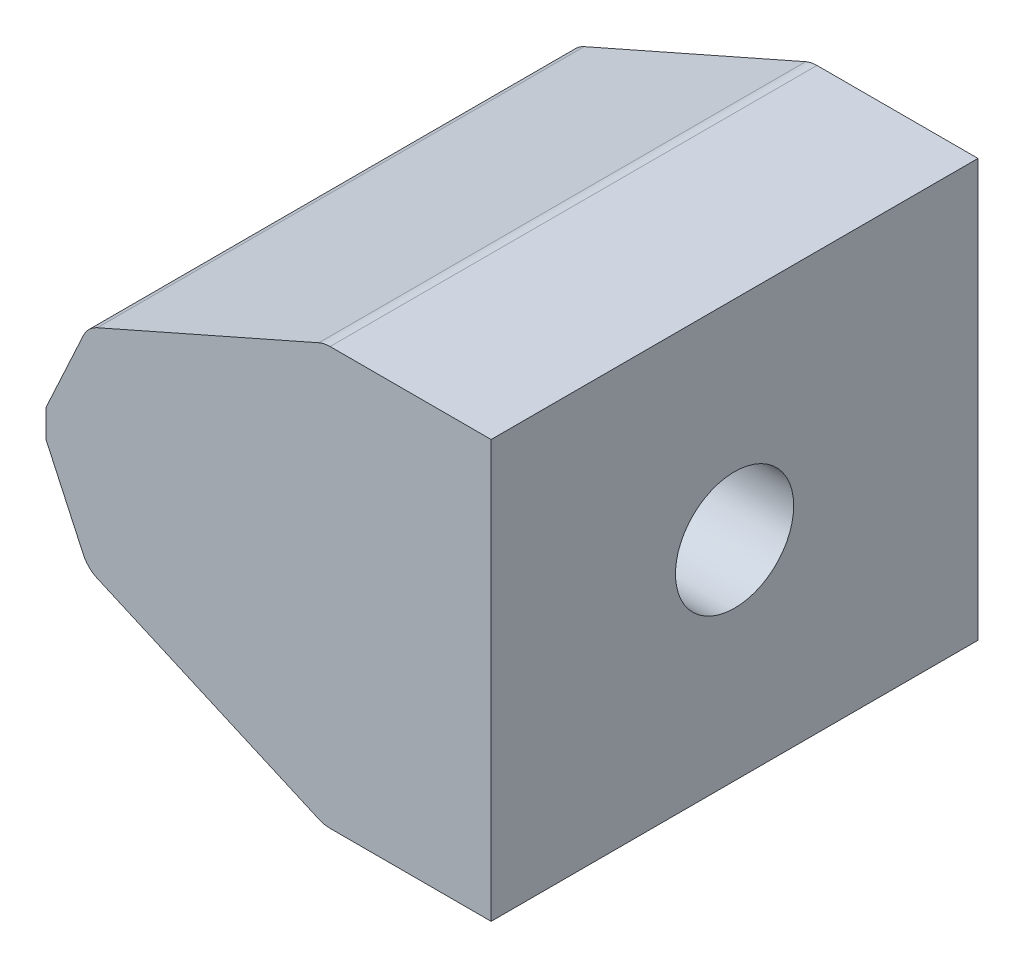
from build123d import *

# Parameters (mm, degrees)
EXTRUSION1_DEPTH           = 17.5
TROU_TARAUD_M10X1_51_D     = 8.5
TROU_TARAUD_M10X1_51_DEPTH = 30
TROU_TARAUD_M10X1_51_TIP   = 2.553657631


with BuildPart() as part:
    # Esquisse1 → Extrusion1 (new, symmetric)
    with BuildSketch(Plane.XY):
        with BuildLine():
            Line((0, -1), (0, 1))
            Line((0, 1), (2.683144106, 6.813478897))
            ThreePointArc((2.683144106, 6.813478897), (3.096860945, 7.401486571), (3.691782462, 7.805198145))
            Line((3.691782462, 7.805198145), (19.614294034, 14.829835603))
            ThreePointArc((19.614294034, 14.829835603), (20.009064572, 14.956996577), (20.421574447, 15))
            Line((20.421574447, 15), (32, 15))
            Line((32, 15), (32, -15))
            Line((32, -15), (20.421574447, -15))
            ThreePointArc((20.421574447, -15), (20.009064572, -14.956996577), (19.614294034, -14.829835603))
            Line((19.614294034, -14.829835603), (3.691782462, -7.805198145))
            ThreePointArc((3.691782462, -7.805198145), (3.096860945, -7.401486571), (2.683144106, -6.813478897))
            Line((2.683144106, -6.813478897), (0, -1))
        make_face()
    extrude(amount=EXTRUSION1_DEPTH, both=True)

    # Trou taraud_ M10x1.51
    with Locations(Plane(origin=(32, 0, 0), x_dir=(0, 0, -1), z_dir=(1, 0, 0))):
        with Locations((0, 0)):
            Hole(TROU_TARAUD_M10X1_51_D / 2, depth=TROU_TARAUD_M10X1_51_DEPTH)
            with Locations((0, 0, -(TROU_TARAUD_M10X1_51_DEPTH + TROU_TARAUD_M10X1_51_TIP / 2))):  # 118° drill point
                Cone(0, TROU_TARAUD_M10X1_51_D / 2, TROU_TARAUD_M10X1_51_TIP, mode=Mode.SUBTRACT)


solid = part.part
